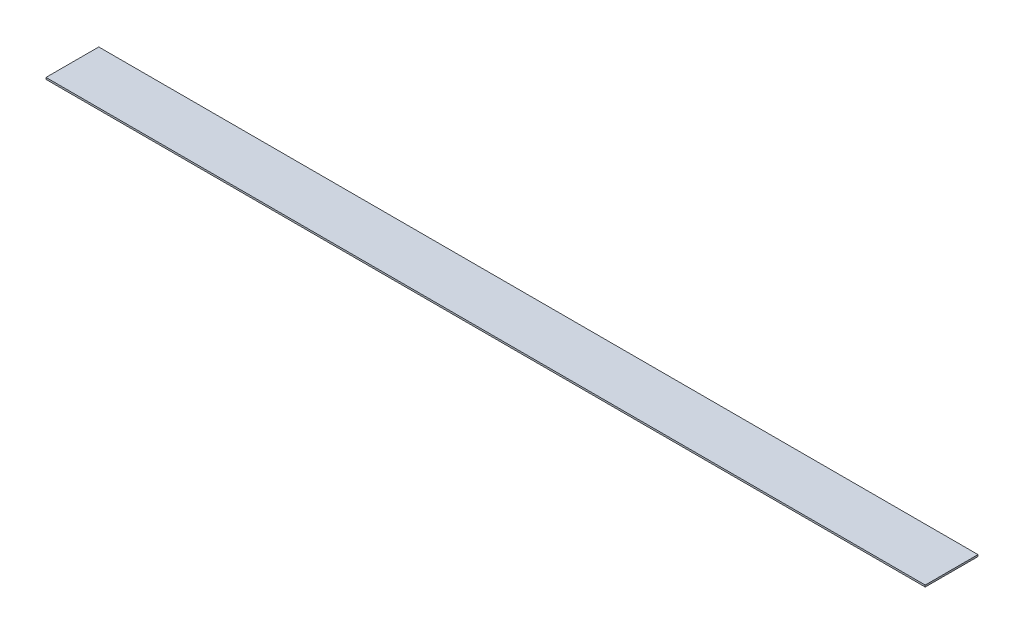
from build123d import *

# Parameters (mm, degrees)
SKETCH1_W      = 12700
SKETCH1_H      = 762
EXTRUDE1_DEPTH = 25.4


with BuildPart() as part:
    # Sketch1 → Extrude1 (new body)
    with BuildSketch(Plane(origin=(0, 0, 0), x_dir=(1, 0, 0), z_dir=(0, 1, 0))):
        with Locations((6350, 0)):
            Rectangle(SKETCH1_W, SKETCH1_H)
    extrude(amount=-EXTRUDE1_DEPTH)


solid = part.part
